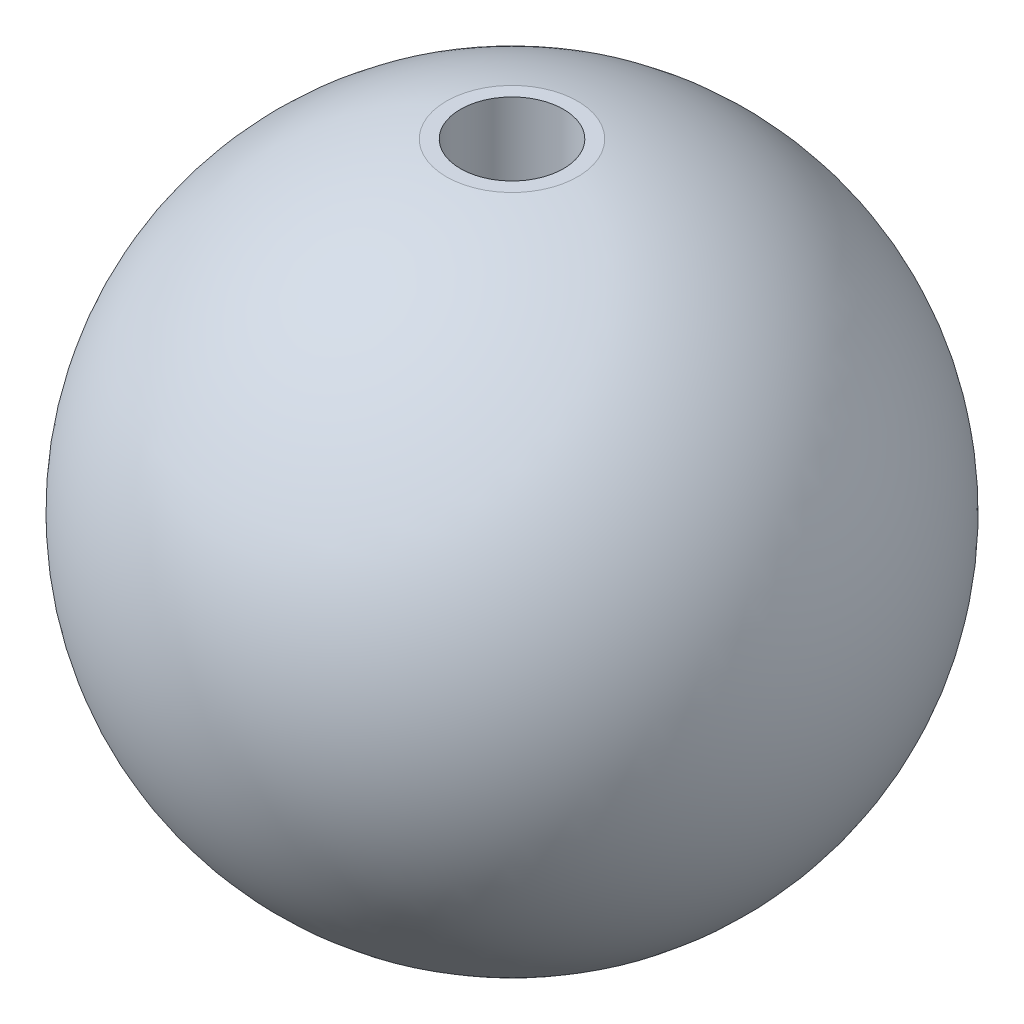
ISO-10303-21;
HEADER;
FILE_DESCRIPTION(('STEP AP214'),'2;1');
FILE_NAME('part.step','',(''),(''),'','','');
FILE_SCHEMA(('AUTOMOTIVE_DESIGN { 1 0 10303 214 1 1 1 1 }'));
ENDSEC;
DATA;
#1=APPLICATION_CONTEXT('core data for automotive mechanical design processes');
#2=APPLICATION_PROTOCOL_DEFINITION('international standard','automotive_design',2000,#1);
#3=PRODUCT_CONTEXT('',#1,'mechanical');
#4=PRODUCT('Part','Part','',(#3));
#5=PRODUCT_RELATED_PRODUCT_CATEGORY('part','',(#4));
#6=PRODUCT_DEFINITION_FORMATION('','',#4);
#7=PRODUCT_DEFINITION_CONTEXT('part definition',#1,'design');
#8=PRODUCT_DEFINITION('design','',#6,#7);
#9=PRODUCT_DEFINITION_SHAPE('','',#8);
#10=(LENGTH_UNIT() NAMED_UNIT(*) SI_UNIT(.MILLI.,.METRE.));
#11=(NAMED_UNIT(*) PLANE_ANGLE_UNIT() SI_UNIT($,.RADIAN.));
#12=(NAMED_UNIT(*) SI_UNIT($,.STERADIAN.) SOLID_ANGLE_UNIT());
#13=UNCERTAINTY_MEASURE_WITH_UNIT(LENGTH_MEASURE(1.E-05),#10,'distance_accuracy_value','');
#14=(GEOMETRIC_REPRESENTATION_CONTEXT(3) GLOBAL_UNCERTAINTY_ASSIGNED_CONTEXT((#13)) GLOBAL_UNIT_ASSIGNED_CONTEXT((#10,
#11,#12)) REPRESENTATION_CONTEXT('',''));
#15=CARTESIAN_POINT('',(0.,0.,0.));
#16=DIRECTION('',(0.,0.,1.));
#17=DIRECTION('',(1.,0.,0.));
#18=AXIS2_PLACEMENT_3D('',#15,#16,#17);
#19=CARTESIAN_POINT('',(0.,0.,0.));
#20=DIRECTION('',(0.,-1.,0.));
#21=DIRECTION('',(-1.,0.,0.));
#22=AXIS2_PLACEMENT_3D('',#19,#20,#21);
#23=SPHERICAL_SURFACE('',#22,25.4);
#24=CARTESIAN_POINT('',(0.,24.892,0.));
#25=DIRECTION('',(0.,1.,0.));
#26=DIRECTION('',(0.,0.,1.));
#27=AXIS2_PLACEMENT_3D('',#24,#25,#26);
#28=CIRCLE('',#27,5.05453618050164);
#29=CARTESIAN_POINT('',(0.,24.892,5.05453618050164));
#30=VERTEX_POINT('',#29);
#31=EDGE_CURVE('E11',#30,#30,#28,.F.);
#32=ORIENTED_EDGE('',*,*,#31,.T.);
#33=EDGE_LOOP('',(#32));
#34=FACE_BOUND('',#33,.T.);
#35=ADVANCED_FACE('F38',(#34),#23,.T.);
#36=CARTESIAN_POINT('',(0.,24.892,0.));
#37=DIRECTION('',(0.,1.,0.));
#38=DIRECTION('',(0.,0.,1.));
#39=AXIS2_PLACEMENT_3D('',#36,#37,#38);
#40=PLANE('',#39);
#41=CARTESIAN_POINT('',(0.,24.892,0.));
#42=DIRECTION('',(0.,1.,0.));
#43=DIRECTION('',(0.,0.,1.));
#44=AXIS2_PLACEMENT_3D('',#41,#42,#43);
#45=CIRCLE('',#44,3.96875);
#46=CARTESIAN_POINT('',(0.,24.892,3.96875));
#47=VERTEX_POINT('',#46);
#48=EDGE_CURVE('E44',#47,#47,#45,.T.);
#49=ORIENTED_EDGE('',*,*,#48,.F.);
#50=EDGE_LOOP('',(#49));
#51=FACE_BOUND('',#50,.T.);
#52=ORIENTED_EDGE('',*,*,#31,.F.);
#53=EDGE_LOOP('',(#52));
#54=FACE_BOUND('',#53,.T.);
#55=ADVANCED_FACE('F61',(#51,#54),#40,.T.);
#56=CARTESIAN_POINT('',(0.,24.892,0.));
#57=DIRECTION('',(0.,1.,0.));
#58=DIRECTION('',(0.,0.,1.));
#59=AXIS2_PLACEMENT_3D('',#56,#57,#58);
#60=CYLINDRICAL_SURFACE('',#59,3.96875);
#61=CARTESIAN_POINT('',(0.,-2.032,0.));
#62=DIRECTION('',(0.,1.,0.));
#63=DIRECTION('',(0.,0.,1.));
#64=AXIS2_PLACEMENT_3D('',#61,#62,#63);
#65=CIRCLE('',#64,3.96874999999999);
#66=CARTESIAN_POINT('',(0.,-2.032,3.96874999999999));
#67=VERTEX_POINT('',#66);
#68=EDGE_CURVE('E54',#67,#67,#65,.T.);
#69=ORIENTED_EDGE('',*,*,#68,.F.);
#70=EDGE_LOOP('',(#69));
#71=FACE_BOUND('',#70,.T.);
#72=ORIENTED_EDGE('',*,*,#48,.T.);
#73=EDGE_LOOP('',(#72));
#74=FACE_BOUND('',#73,.T.);
#75=ADVANCED_FACE('F50',(#71,#74),#60,.F.);
#76=CARTESIAN_POINT('',(0.,-2.032,0.));
#77=DIRECTION('',(0.,1.,0.));
#78=DIRECTION('',(0.,0.,1.));
#79=AXIS2_PLACEMENT_3D('',#76,#77,#78);
#80=CONICAL_SURFACE('',#79,3.96874999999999,1.02974425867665);
#81=CARTESIAN_POINT('',(0.,-4.41666558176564,0.));
#82=VERTEX_POINT('',#81);
#83=VERTEX_LOOP('',#82);
#84=FACE_BOUND('',#83,.T.);
#85=ORIENTED_EDGE('',*,*,#68,.T.);
#86=EDGE_LOOP('',(#85));
#87=FACE_BOUND('',#86,.T.);
#88=ADVANCED_FACE('F47',(#84,#87),#80,.F.);
#89=CLOSED_SHELL('',(#35,#55,#75,#88));
#90=MANIFOLD_SOLID_BREP('B2',#89);
#91=ADVANCED_BREP_SHAPE_REPRESENTATION('',(#18,#90),#14);
#92=SHAPE_DEFINITION_REPRESENTATION(#9,#91);
ENDSEC;
END-ISO-10303-21;
